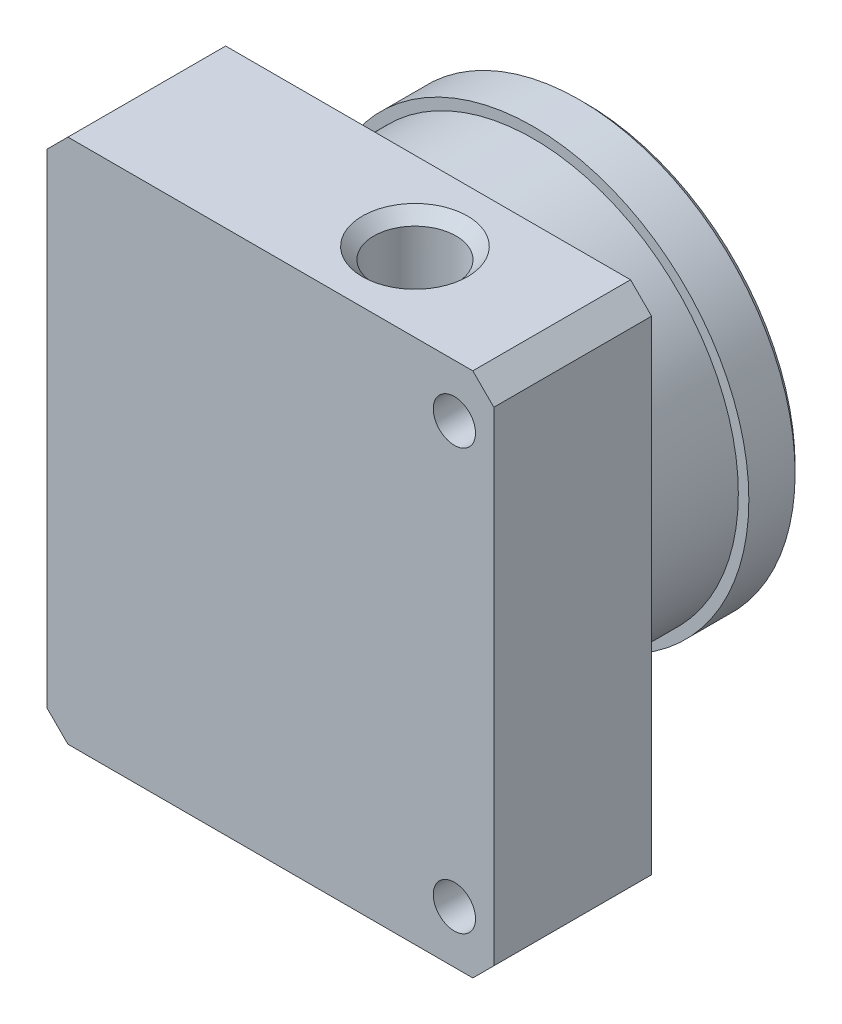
from build123d import *

# Parameters (mm, degrees)
SKETCH1_W                          = 53.975
SKETCH1_H                          = 63.5
BODY_DEPTH                         = 19.05
SKETCH17_R                         = 2.38125
INTERNAL_PUMP_PORTS_DEPTH          = 9.525
SKETCH21_R                         = 26.035
SKETCH21_R_2                       = 22.225
MOCAP_BOSS_DEPTH                   = 19.05
CHAMFER5_SIZE                      = 0.762
PUMP_START                         = -1.27
SKETCH22_R                         = 22.225
PUMP_POCKET_DEPTH                  = 1.27
BLOCK_CORNERS_SIZE                 = 2.54
SKETCH23_R                         = 5.55625
MCBH_HOLE_DEPTH                    = 25.4
INTERNAL_WIRE_POCKET_DEPTH         = 10.16
SKETCH25_R                         = 2.5527
MOUNTING_HOLES_DEPTH               = 46.818011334
SKETCH27_R                         = 2.5527
OUTLET_PORT_DEPTH                  = 25.4
SKETCH31_W                         = 12.7
SKETCH31_H                         = 1.27
SKETCH32_R                         = 3.4925
LURE_COMP_PORT_DEPTH               = 25.4
F_7_16_20_TAPPED_HOLE1_D           = 9.92124
F_7_16_20_TAPPED_HOLE1_DEPTH       = 15.875
F_7_16_20_TAPPED_HOLE1_CSINK_D     = 12.7
F_7_16_20_TAPPED_HOLE1_CSINK_ANGLE = 90
F_7_16_20_TAPPED_HOLE1_TIP         = 2.980641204
F_7_16_20_TAPPED_HOLE2_D           = 9.92124
F_7_16_20_TAPPED_HOLE2_DEPTH       = 17.78
F_7_16_20_TAPPED_HOLE2_CSINK_D     = 12.7
F_7_16_20_TAPPED_HOLE2_CSINK_ANGLE = 90
F_7_16_20_TAPPED_HOLE2_TIP         = 2.980641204
CHAMFER7_SIZE                      = 0.508


with BuildPart() as part:
    # Sketch1 → body (new body)
    with BuildSketch(Plane.XY):
        Rectangle(SKETCH1_W, SKETCH1_H)
    extrude(amount=BODY_DEPTH)

    # Sketch17 → internal pump ports (cut)
    with BuildSketch(Plane(origin=(0, 0, 0), x_dir=(-1, 0, 0), z_dir=(0, 0, -1))):
        with Locations((-5.0038, 19.05)):
            Circle(SKETCH17_R)
        with Locations((5.0038, 19.05)):
            Circle(SKETCH17_R)
    extrude(amount=-INTERNAL_PUMP_PORTS_DEPTH, mode=Mode.SUBTRACT)

    # Sketch21 → mocap boss (add)
    with BuildSketch(Plane(origin=(0, 0, 0), x_dir=(-1, 0, 0), z_dir=(0, 0, -1))):
        with Locations(Location((0, 3.175, 0), (0, 0, 180))):
            Circle(SKETCH21_R)
        with Locations(Location((0, 3.175, 0), (0, 0, 180))):
            Circle(SKETCH21_R_2, mode=Mode.SUBTRACT)
    extrude(amount=MOCAP_BOSS_DEPTH)

    # Chamfer5
    chamfer5_edges = [part.edges().sort_by_distance(p)[0] for p in [
        (-26.035, 3.175, -19.05),
        (-22.225, 3.175, -19.05),
    ]]
    chamfer(chamfer5_edges, length=CHAMFER5_SIZE)

    # Sketch22 → pump pocket (cut)
    with BuildSketch(Plane(origin=(0, 0, 0), x_dir=(-1, 0, 0), z_dir=(0, 0, -1)).offset(PUMP_START)):
        with Locations(Location((0, 3.175, 0), (0, 0, 180))):
            Circle(SKETCH22_R)
    extrude(amount=PUMP_POCKET_DEPTH, mode=Mode.SUBTRACT)

    # block corners
    block_corners_edges = [part.edges().sort_by_distance(p)[0] for p in [
        (-26.9875, 31.75, 9.525),
        (26.9875, 31.75, 9.525),
        (26.9875, -31.75, 9.525),
        (-26.9875, -31.75, 9.525),
    ]]
    chamfer(block_corners_edges, length=BLOCK_CORNERS_SIZE)

    # Sketch23 → MCBH hole (cut)
    with BuildSketch(Plane.XZ.offset(31.75)):
        with Locations((7.9375, 9.525)):
            Circle(SKETCH23_R)
    extrude(amount=-MCBH_HOLE_DEPTH, mode=Mode.SUBTRACT)

    # Sketch24 → internal wire pocket (cut)
    with BuildSketch(Plane(origin=(0, 0, 1.27), x_dir=(-1, 0, 0), z_dir=(0, 0, -1))):
        with BuildLine():
            Line((-12.7, 6.0325), (12.7, 6.0325))
            ThreePointArc((12.7, 6.0325), (20.6375, -1.905), (12.7, -9.8425))
            Line((12.7, -9.8425), (-12.7, -9.8425))
            ThreePointArc((-12.7, -9.8425), (-20.6375, -1.905), (-12.7, 6.0325))
        make_face()
    extrude(amount=-INTERNAL_WIRE_POCKET_DEPTH, mode=Mode.SUBTRACT)

    # Sketch25 → mounting holes (cut, through all)
    with BuildSketch(Plane(origin=(0, 0, 0), x_dir=(-1, 0, 0), z_dir=(0, 0, -1))):
        with Locations((-22.225, 25.4)):
            Circle(SKETCH25_R)
        with Locations((-22.225, -25.4)):
            Circle(SKETCH25_R)
    extrude(amount=-MOUNTING_HOLES_DEPTH, mode=Mode.SUBTRACT)

    # Sketch27 → outlet port (cut)
    with BuildSketch(Plane.ZY.offset(26.9875)):
        with Locations(Location((9.525, 19.05, 0), (0, 0, 270))):
            Circle(SKETCH27_R)
    extrude(amount=-OUTLET_PORT_DEPTH, mode=Mode.SUBTRACT)

    # Sketch31 → clamping groove (revolve, cut)
    with BuildSketch(Plane(origin=(0, 0, 0), x_dir=(0, 0, -1), z_dir=(1, 0, 0)), mode=Mode.PRIVATE) as clamping_groove_sk:
        with Locations((6.35, 28.575)):
            Rectangle(SKETCH31_W, SKETCH31_H)
    revolve(clamping_groove_sk.sketch.rotate(Axis((0, 3.175, -55.75532701), (0, 0, 1)), 90), axis=Axis((0, 3.175, -55.75532701), (0, 0, 1)), mode=Mode.SUBTRACT)

    # Sketch32 → lure comp port (cut)
    with BuildSketch(Plane.XZ.offset(31.75)):
        with Locations((-14.2875, 9.525)):
            Circle(SKETCH32_R)
    extrude(amount=-LURE_COMP_PORT_DEPTH, mode=Mode.SUBTRACT)

    # 7_16-20 Tapped Hole1
    with Locations(Plane.ZY.offset(26.9875)):
        with Locations((9.525, 19.05)):
            CounterSinkHole(F_7_16_20_TAPPED_HOLE1_D / 2, F_7_16_20_TAPPED_HOLE1_CSINK_D / 2, depth=F_7_16_20_TAPPED_HOLE1_DEPTH, counter_sink_angle=F_7_16_20_TAPPED_HOLE1_CSINK_ANGLE)
            with Locations((0, 0, -(F_7_16_20_TAPPED_HOLE1_DEPTH + F_7_16_20_TAPPED_HOLE1_TIP / 2))):  # 118° drill point
                Cone(0, F_7_16_20_TAPPED_HOLE1_D / 2, F_7_16_20_TAPPED_HOLE1_TIP, mode=Mode.SUBTRACT)

    # 7_16-20 Tapped Hole2
    with Locations(Plane(origin=(0, 31.75, 0), x_dir=(-1, 0, 0), z_dir=(0, 1, 0))):
        with Locations((-7.9375, 9.525)):
            CounterSinkHole(F_7_16_20_TAPPED_HOLE2_D / 2, F_7_16_20_TAPPED_HOLE2_CSINK_D / 2, depth=F_7_16_20_TAPPED_HOLE2_DEPTH, counter_sink_angle=F_7_16_20_TAPPED_HOLE2_CSINK_ANGLE)
            with Locations((0, 0, -(F_7_16_20_TAPPED_HOLE2_DEPTH + F_7_16_20_TAPPED_HOLE2_TIP / 2))):  # 118° drill point
                Cone(0, F_7_16_20_TAPPED_HOLE2_D / 2, F_7_16_20_TAPPED_HOLE2_TIP, mode=Mode.SUBTRACT)

    # Chamfer7
    chamfer7_edges = [part.edges().sort_by_distance(p)[0] for p in [
        (7.38505, 19.05, 1.27),
        (-2.62255, 19.05, 1.27),
    ]]
    chamfer(chamfer7_edges, length=CHAMFER7_SIZE)


solid = part.part
